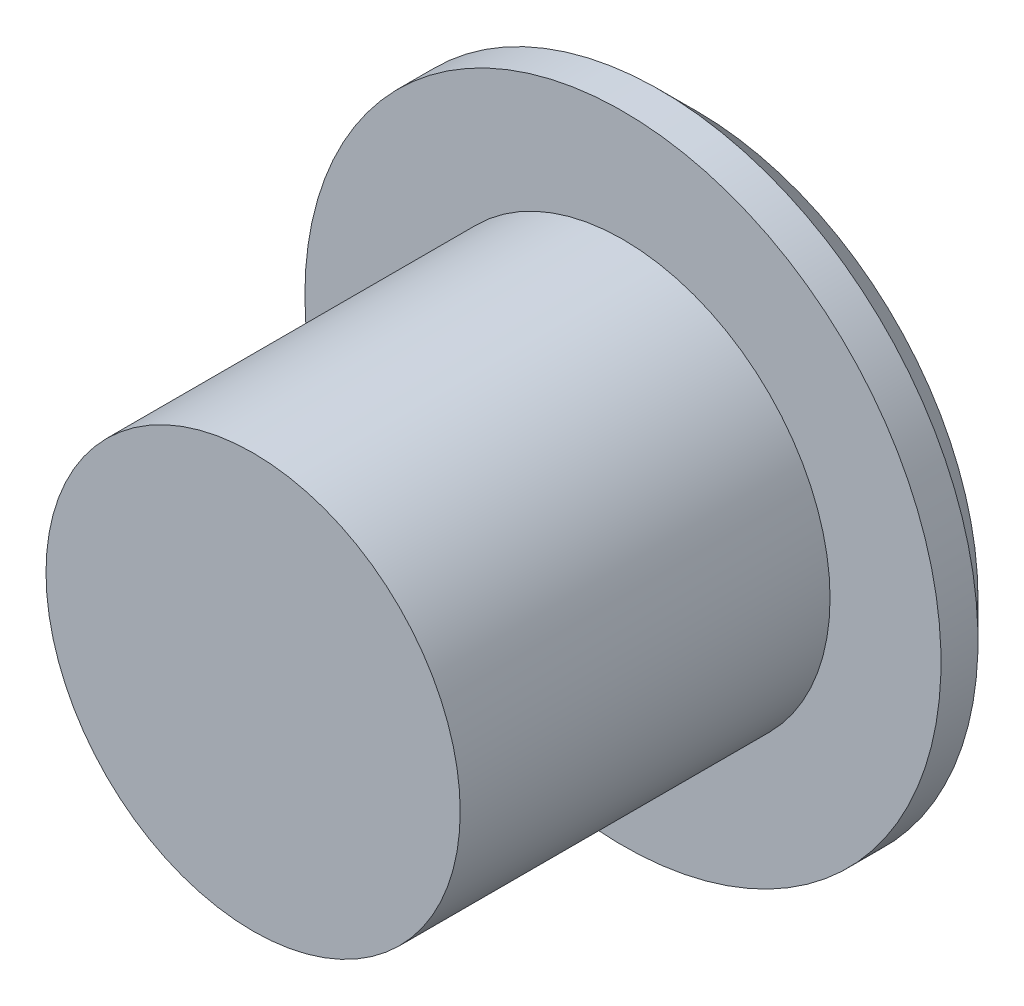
ISO-10303-21;
HEADER;
FILE_DESCRIPTION(('STEP AP214'),'2;1');
FILE_NAME('part.step','',(''),(''),'','','');
FILE_SCHEMA(('AUTOMOTIVE_DESIGN { 1 0 10303 214 1 1 1 1 }'));
ENDSEC;
DATA;
#1=APPLICATION_CONTEXT('core data for automotive mechanical design processes');
#2=APPLICATION_PROTOCOL_DEFINITION('international standard','automotive_design',2000,#1);
#3=PRODUCT_CONTEXT('',#1,'mechanical');
#4=PRODUCT('Part','Part','',(#3));
#5=PRODUCT_RELATED_PRODUCT_CATEGORY('part','',(#4));
#6=PRODUCT_DEFINITION_FORMATION('','',#4);
#7=PRODUCT_DEFINITION_CONTEXT('part definition',#1,'design');
#8=PRODUCT_DEFINITION('design','',#6,#7);
#9=PRODUCT_DEFINITION_SHAPE('','',#8);
#10=(LENGTH_UNIT() NAMED_UNIT(*) SI_UNIT(.MILLI.,.METRE.));
#11=(NAMED_UNIT(*) PLANE_ANGLE_UNIT() SI_UNIT($,.RADIAN.));
#12=(NAMED_UNIT(*) SI_UNIT($,.STERADIAN.) SOLID_ANGLE_UNIT());
#13=UNCERTAINTY_MEASURE_WITH_UNIT(LENGTH_MEASURE(1.E-05),#10,'distance_accuracy_value','');
#14=(GEOMETRIC_REPRESENTATION_CONTEXT(3) GLOBAL_UNCERTAINTY_ASSIGNED_CONTEXT((#13)) GLOBAL_UNIT_ASSIGNED_CONTEXT((#10,
#11,#12)) REPRESENTATION_CONTEXT('',''));
#15=CARTESIAN_POINT('',(0.,0.,0.));
#16=DIRECTION('',(0.,0.,1.));
#17=DIRECTION('',(1.,0.,0.));
#18=AXIS2_PLACEMENT_3D('',#15,#16,#17);
#19=CARTESIAN_POINT('',(0.,0.,5.));
#20=DIRECTION('',(0.,0.,-1.));
#21=DIRECTION('',(-1.,0.,0.));
#22=AXIS2_PLACEMENT_3D('',#19,#20,#21);
#23=CYLINDRICAL_SURFACE('',#22,2.8);
#24=CARTESIAN_POINT('',(0.,0.,5.));
#25=DIRECTION('',(0.,0.,1.));
#26=DIRECTION('',(1.,0.,0.));
#27=AXIS2_PLACEMENT_3D('',#24,#25,#26);
#28=CIRCLE('',#27,2.8);
#29=CARTESIAN_POINT('',(2.8,0.,5.));
#30=VERTEX_POINT('',#29);
#31=EDGE_CURVE('E45',#30,#30,#28,.T.);
#32=ORIENTED_EDGE('',*,*,#31,.F.);
#33=EDGE_LOOP('',(#32));
#34=FACE_BOUND('',#33,.T.);
#35=CARTESIAN_POINT('',(0.,0.,0.));
#36=DIRECTION('',(0.,0.,1.));
#37=DIRECTION('',(1.,0.,0.));
#38=AXIS2_PLACEMENT_3D('',#35,#36,#37);
#39=CIRCLE('',#38,2.8);
#40=CARTESIAN_POINT('',(2.8,0.,0.));
#41=VERTEX_POINT('',#40);
#42=EDGE_CURVE('E49',#41,#41,#39,.T.);
#43=ORIENTED_EDGE('',*,*,#42,.T.);
#44=EDGE_LOOP('',(#43));
#45=FACE_BOUND('',#44,.T.);
#46=ADVANCED_FACE('F33',(#34,#45),#23,.T.);
#47=CARTESIAN_POINT('',(0.,0.,5.));
#48=DIRECTION('',(0.,0.,1.));
#49=DIRECTION('',(1.,0.,0.));
#50=AXIS2_PLACEMENT_3D('',#47,#48,#49);
#51=PLANE('',#50);
#52=ORIENTED_EDGE('',*,*,#31,.T.);
#53=EDGE_LOOP('',(#52));
#54=FACE_BOUND('',#53,.T.);
#55=ADVANCED_FACE('F74',(#54),#51,.T.);
#56=CARTESIAN_POINT('',(0.,0.,-1.));
#57=DIRECTION('',(0.,0.,1.));
#58=DIRECTION('',(1.,0.,0.));
#59=AXIS2_PLACEMENT_3D('',#56,#57,#58);
#60=CYLINDRICAL_SURFACE('',#59,4.3);
#61=CARTESIAN_POINT('',(0.,0.,-0.499999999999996));
#62=DIRECTION('',(0.,0.,-1.));
#63=DIRECTION('',(-1.,0.,0.));
#64=AXIS2_PLACEMENT_3D('',#61,#62,#63);
#65=CIRCLE('',#64,4.3);
#66=CARTESIAN_POINT('',(-4.3,0.,-0.499999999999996));
#67=VERTEX_POINT('',#66);
#68=EDGE_CURVE('E10',#67,#67,#65,.F.);
#69=ORIENTED_EDGE('',*,*,#68,.T.);
#70=EDGE_LOOP('',(#69));
#71=FACE_BOUND('',#70,.T.);
#72=CARTESIAN_POINT('',(0.,0.,0.));
#73=DIRECTION('',(0.,0.,-1.));
#74=DIRECTION('',(-1.,0.,0.));
#75=AXIS2_PLACEMENT_3D('',#72,#73,#74);
#76=CIRCLE('',#75,4.3);
#77=CARTESIAN_POINT('',(-4.3,0.,0.));
#78=VERTEX_POINT('',#77);
#79=EDGE_CURVE('E53',#78,#78,#76,.T.);
#80=ORIENTED_EDGE('',*,*,#79,.T.);
#81=EDGE_LOOP('',(#80));
#82=FACE_BOUND('',#81,.T.);
#83=ADVANCED_FACE('F58',(#71,#82),#60,.T.);
#84=CARTESIAN_POINT('',(0.,0.,-1.));
#85=DIRECTION('',(0.,0.,-1.));
#86=DIRECTION('',(-1.,0.,0.));
#87=AXIS2_PLACEMENT_3D('',#84,#85,#86);
#88=PLANE('',#87);
#89=CARTESIAN_POINT('',(0.,0.,-1.));
#90=DIRECTION('',(0.,0.,-1.));
#91=DIRECTION('',(-1.,0.,0.));
#92=AXIS2_PLACEMENT_3D('',#89,#90,#91);
#93=CIRCLE('',#92,3.8);
#94=CARTESIAN_POINT('',(-3.8,0.,-1.));
#95=VERTEX_POINT('',#94);
#96=EDGE_CURVE('E41',#95,#95,#93,.T.);
#97=ORIENTED_EDGE('',*,*,#96,.T.);
#98=EDGE_LOOP('',(#97));
#99=FACE_BOUND('',#98,.T.);
#100=ADVANCED_FACE('F62',(#99),#88,.T.);
#101=CARTESIAN_POINT('',(0.,0.,0.));
#102=DIRECTION('',(0.,0.,-1.));
#103=DIRECTION('',(-1.,0.,0.));
#104=AXIS2_PLACEMENT_3D('',#101,#102,#103);
#105=PLANE('',#104);
#106=ORIENTED_EDGE('',*,*,#42,.F.);
#107=EDGE_LOOP('',(#106));
#108=FACE_BOUND('',#107,.T.);
#109=ORIENTED_EDGE('',*,*,#79,.F.);
#110=EDGE_LOOP('',(#109));
#111=FACE_BOUND('',#110,.T.);
#112=ADVANCED_FACE('F60',(#108,#111),#105,.F.);
#113=CARTESIAN_POINT('',(0.,0.,-1.));
#114=DIRECTION('',(0.,0.,1.));
#115=DIRECTION('',(1.,0.,0.));
#116=AXIS2_PLACEMENT_3D('',#113,#114,#115);
#117=CONICAL_SURFACE('',#116,3.8,0.785398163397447);
#118=ORIENTED_EDGE('',*,*,#68,.F.);
#119=EDGE_LOOP('',(#118));
#120=FACE_BOUND('',#119,.T.);
#121=ORIENTED_EDGE('',*,*,#96,.F.);
#122=EDGE_LOOP('',(#121));
#123=FACE_BOUND('',#122,.T.);
#124=ADVANCED_FACE('F36',(#120,#123),#117,.T.);
#125=CLOSED_SHELL('',(#46,#55,#83,#100,#112,#124));
#126=MANIFOLD_SOLID_BREP('B2',#125);
#127=ADVANCED_BREP_SHAPE_REPRESENTATION('',(#18,#126),#14);
#128=SHAPE_DEFINITION_REPRESENTATION(#9,#127);
ENDSEC;
END-ISO-10303-21;
